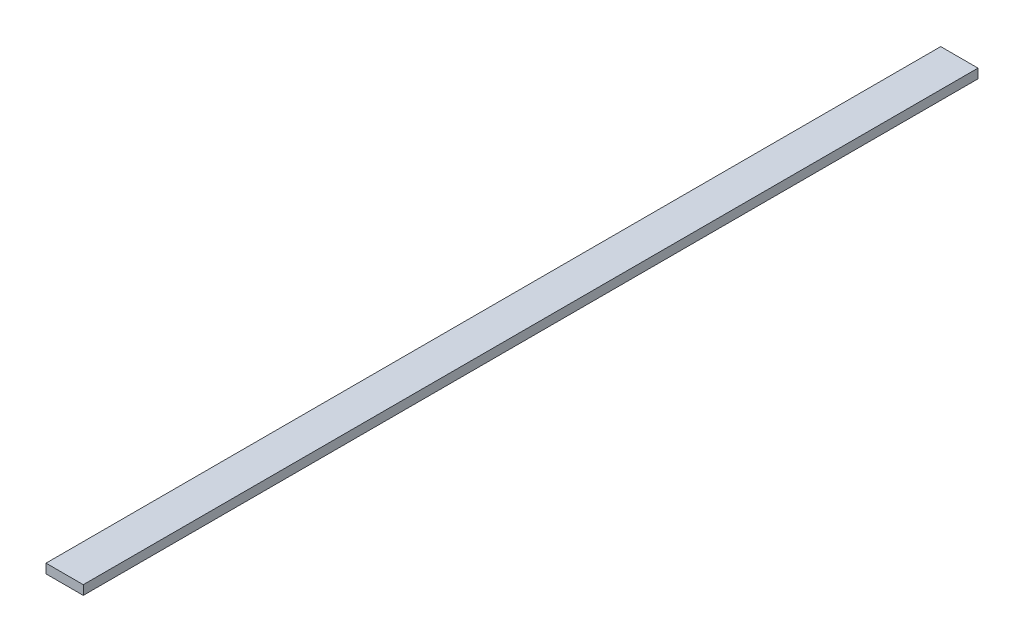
ISO-10303-21;
HEADER;
FILE_DESCRIPTION(('STEP AP214'),'2;1');
FILE_NAME('part.step','',(''),(''),'','','');
FILE_SCHEMA(('AUTOMOTIVE_DESIGN { 1 0 10303 214 1 1 1 1 }'));
ENDSEC;
DATA;
#1=APPLICATION_CONTEXT('core data for automotive mechanical design processes');
#2=APPLICATION_PROTOCOL_DEFINITION('international standard','automotive_design',2000,#1);
#3=PRODUCT_CONTEXT('',#1,'mechanical');
#4=PRODUCT('Part','Part','',(#3));
#5=PRODUCT_RELATED_PRODUCT_CATEGORY('part','',(#4));
#6=PRODUCT_DEFINITION_FORMATION('','',#4);
#7=PRODUCT_DEFINITION_CONTEXT('part definition',#1,'design');
#8=PRODUCT_DEFINITION('design','',#6,#7);
#9=PRODUCT_DEFINITION_SHAPE('','',#8);
#10=(LENGTH_UNIT() NAMED_UNIT(*) SI_UNIT(.MILLI.,.METRE.));
#11=(NAMED_UNIT(*) PLANE_ANGLE_UNIT() SI_UNIT($,.RADIAN.));
#12=(NAMED_UNIT(*) SI_UNIT($,.STERADIAN.) SOLID_ANGLE_UNIT());
#13=UNCERTAINTY_MEASURE_WITH_UNIT(LENGTH_MEASURE(1.E-05),#10,'distance_accuracy_value','');
#14=(GEOMETRIC_REPRESENTATION_CONTEXT(3) GLOBAL_UNCERTAINTY_ASSIGNED_CONTEXT((#13)) GLOBAL_UNIT_ASSIGNED_CONTEXT((#10,
#11,#12)) REPRESENTATION_CONTEXT('',''));
#15=CARTESIAN_POINT('',(0.,0.,0.));
#16=DIRECTION('',(0.,0.,1.));
#17=DIRECTION('',(1.,0.,0.));
#18=AXIS2_PLACEMENT_3D('',#15,#16,#17);
#19=CARTESIAN_POINT('',(50.8,12.7,2438.4));
#20=DIRECTION('',(-1.,0.,0.));
#21=DIRECTION('',(0.,0.,1.));
#22=AXIS2_PLACEMENT_3D('',#19,#20,#21);
#23=PLANE('',#22);
#24=DIRECTION('',(0.,1.,0.));
#25=VECTOR('',#24,1.);
#26=CARTESIAN_POINT('',(50.8,12.7,0.));
#27=LINE('',#26,#25);
#28=CARTESIAN_POINT('',(50.8,-12.7,0.));
#29=VERTEX_POINT('',#28);
#30=CARTESIAN_POINT('',(50.8,12.7,0.));
#31=VERTEX_POINT('',#30);
#32=EDGE_CURVE('E96',#29,#31,#27,.T.);
#33=ORIENTED_EDGE('',*,*,#32,.T.);
#34=DIRECTION('',(0.,0.,-1.));
#35=VECTOR('',#34,1.);
#36=CARTESIAN_POINT('',(50.8,12.7,2438.4));
#37=LINE('',#36,#35);
#38=CARTESIAN_POINT('',(50.8,12.7,2438.4));
#39=VERTEX_POINT('',#38);
#40=EDGE_CURVE('E11',#39,#31,#37,.T.);
#41=ORIENTED_EDGE('',*,*,#40,.F.);
#42=DIRECTION('',(0.,1.,0.));
#43=VECTOR('',#42,1.);
#44=CARTESIAN_POINT('',(50.8,12.7,2438.4));
#45=LINE('',#44,#43);
#46=CARTESIAN_POINT('',(50.8,-12.7,2438.4));
#47=VERTEX_POINT('',#46);
#48=EDGE_CURVE('E84',#47,#39,#45,.T.);
#49=ORIENTED_EDGE('',*,*,#48,.F.);
#50=DIRECTION('',(0.,0.,-1.));
#51=VECTOR('',#50,1.);
#52=CARTESIAN_POINT('',(50.8,-12.7,2438.4));
#53=LINE('',#52,#51);
#54=EDGE_CURVE('E92',#47,#29,#53,.T.);
#55=ORIENTED_EDGE('',*,*,#54,.T.);
#56=EDGE_LOOP('',(#33,#41,#49,#55));
#57=FACE_BOUND('',#56,.T.);
#58=ADVANCED_FACE('F33',(#57),#23,.F.);
#59=CARTESIAN_POINT('',(-50.8,12.7,2438.4));
#60=DIRECTION('',(0.,-1.,0.));
#61=DIRECTION('',(0.,0.,-1.));
#62=AXIS2_PLACEMENT_3D('',#59,#60,#61);
#63=PLANE('',#62);
#64=DIRECTION('',(-1.,0.,0.));
#65=VECTOR('',#64,1.);
#66=CARTESIAN_POINT('',(-50.8,12.7,0.));
#67=LINE('',#66,#65);
#68=CARTESIAN_POINT('',(-50.8,12.7,0.));
#69=VERTEX_POINT('',#68);
#70=EDGE_CURVE('E88',#31,#69,#67,.T.);
#71=ORIENTED_EDGE('',*,*,#70,.T.);
#72=DIRECTION('',(0.,0.,-1.));
#73=VECTOR('',#72,1.);
#74=CARTESIAN_POINT('',(-50.8,12.7,2438.4));
#75=LINE('',#74,#73);
#76=CARTESIAN_POINT('',(-50.8,12.7,2438.4));
#77=VERTEX_POINT('',#76);
#78=EDGE_CURVE('E41',#77,#69,#75,.T.);
#79=ORIENTED_EDGE('',*,*,#78,.F.);
#80=DIRECTION('',(-1.,0.,0.));
#81=VECTOR('',#80,1.);
#82=CARTESIAN_POINT('',(-50.8,12.7,2438.4));
#83=LINE('',#82,#81);
#84=EDGE_CURVE('E79',#39,#77,#83,.T.);
#85=ORIENTED_EDGE('',*,*,#84,.F.);
#86=ORIENTED_EDGE('',*,*,#40,.T.);
#87=EDGE_LOOP('',(#71,#79,#85,#86));
#88=FACE_BOUND('',#87,.T.);
#89=ADVANCED_FACE('F87',(#88),#63,.F.);
#90=CARTESIAN_POINT('',(-50.8,12.7,2438.4));
#91=DIRECTION('',(1.,0.,0.));
#92=DIRECTION('',(0.,1.,0.));
#93=AXIS2_PLACEMENT_3D('',#90,#91,#92);
#94=PLANE('',#93);
#95=DIRECTION('',(0.,-1.,0.));
#96=VECTOR('',#95,1.);
#97=CARTESIAN_POINT('',(-50.8,12.7,0.));
#98=LINE('',#97,#96);
#99=CARTESIAN_POINT('',(-50.8,-12.7,0.));
#100=VERTEX_POINT('',#99);
#101=EDGE_CURVE('E66',#69,#100,#98,.T.);
#102=ORIENTED_EDGE('',*,*,#101,.T.);
#103=DIRECTION('',(0.,0.,-1.));
#104=VECTOR('',#103,1.);
#105=CARTESIAN_POINT('',(-50.8,-12.7,2438.4));
#106=LINE('',#105,#104);
#107=CARTESIAN_POINT('',(-50.8,-12.7,2438.4));
#108=VERTEX_POINT('',#107);
#109=EDGE_CURVE('E89',#108,#100,#106,.T.);
#110=ORIENTED_EDGE('',*,*,#109,.F.);
#111=DIRECTION('',(0.,-1.,0.));
#112=VECTOR('',#111,1.);
#113=CARTESIAN_POINT('',(-50.8,12.7,2438.4));
#114=LINE('',#113,#112);
#115=EDGE_CURVE('E82',#77,#108,#114,.T.);
#116=ORIENTED_EDGE('',*,*,#115,.F.);
#117=ORIENTED_EDGE('',*,*,#78,.T.);
#118=EDGE_LOOP('',(#102,#110,#116,#117));
#119=FACE_BOUND('',#118,.T.);
#120=ADVANCED_FACE('F90',(#119),#94,.F.);
#121=CARTESIAN_POINT('',(-50.8,-12.7,2438.4));
#122=DIRECTION('',(0.,1.,0.));
#123=DIRECTION('',(0.,0.,1.));
#124=AXIS2_PLACEMENT_3D('',#121,#122,#123);
#125=PLANE('',#124);
#126=DIRECTION('',(1.,0.,0.));
#127=VECTOR('',#126,1.);
#128=CARTESIAN_POINT('',(-50.8,-12.7,0.));
#129=LINE('',#128,#127);
#130=EDGE_CURVE('E72',#100,#29,#129,.T.);
#131=ORIENTED_EDGE('',*,*,#130,.T.);
#132=ORIENTED_EDGE('',*,*,#54,.F.);
#133=DIRECTION('',(1.,0.,0.));
#134=VECTOR('',#133,1.);
#135=CARTESIAN_POINT('',(-50.8,-12.7,2438.4));
#136=LINE('',#135,#134);
#137=EDGE_CURVE('E49',#108,#47,#136,.T.);
#138=ORIENTED_EDGE('',*,*,#137,.F.);
#139=ORIENTED_EDGE('',*,*,#109,.T.);
#140=EDGE_LOOP('',(#131,#132,#138,#139));
#141=FACE_BOUND('',#140,.T.);
#142=ADVANCED_FACE('F103',(#141),#125,.F.);
#143=CARTESIAN_POINT('',(0.,0.,2438.4));
#144=DIRECTION('',(0.,0.,1.));
#145=DIRECTION('',(1.,0.,0.));
#146=AXIS2_PLACEMENT_3D('',#143,#144,#145);
#147=PLANE('',#146);
#148=ORIENTED_EDGE('',*,*,#48,.T.);
#149=ORIENTED_EDGE('',*,*,#84,.T.);
#150=ORIENTED_EDGE('',*,*,#115,.T.);
#151=ORIENTED_EDGE('',*,*,#137,.T.);
#152=EDGE_LOOP('',(#148,#149,#150,#151));
#153=FACE_BOUND('',#152,.T.);
#154=ADVANCED_FACE('F80',(#153),#147,.T.);
#155=CARTESIAN_POINT('',(0.,0.,0.));
#156=DIRECTION('',(0.,0.,1.));
#157=DIRECTION('',(1.,0.,0.));
#158=AXIS2_PLACEMENT_3D('',#155,#156,#157);
#159=PLANE('',#158);
#160=ORIENTED_EDGE('',*,*,#32,.F.);
#161=ORIENTED_EDGE('',*,*,#130,.F.);
#162=ORIENTED_EDGE('',*,*,#101,.F.);
#163=ORIENTED_EDGE('',*,*,#70,.F.);
#164=EDGE_LOOP('',(#160,#161,#162,#163));
#165=FACE_BOUND('',#164,.T.);
#166=ADVANCED_FACE('F106',(#165),#159,.F.);
#167=CLOSED_SHELL('',(#58,#89,#120,#142,#154,#166));
#168=MANIFOLD_SOLID_BREP('B2',#167);
#169=ADVANCED_BREP_SHAPE_REPRESENTATION('',(#18,#168),#14);
#170=SHAPE_DEFINITION_REPRESENTATION(#9,#169);
ENDSEC;
END-ISO-10303-21;
